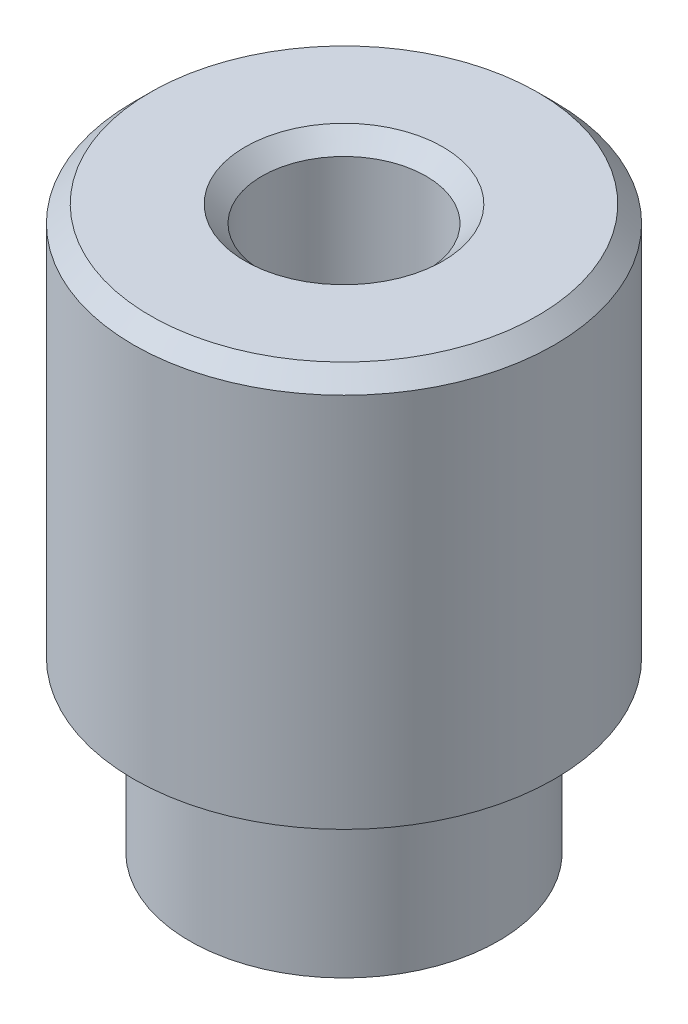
from build123d import *

# Parameters (mm, degrees)
ENL_V_MAT_EXTRU_1_DEPTH = 8
CHANFREIN1_SIZE         = 0.6


with BuildPart() as part:
    # Esquisse2 → R_volution1 (revolve)
    with BuildSketch(Plane.XY, mode=Mode.PRIVATE) as r_volution1_sk:
        with BuildLine():
            Line((-7.5, 20), (-2.925, 20))
            Line((-2.925, 20), (-2.925, 9.5))
            ThreePointArc((-2.925, 9.5), (-2.485660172, 8.439339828), (-1.425, 8))
            Line((-1.425, 8), (0, 8))
            Line((0, 8), (0, 0))
            Line((0, 0), (-5.5, 0))
            Line((-5.5, 0), (-5.5, 5.4))
            ThreePointArc((-5.5, 5.4), (-5.675735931, 5.824264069), (-6.1, 6))
            Line((-6.1, 6), (-7.5, 6))
            Line((-7.5, 6), (-7.5, 20))
        make_face()
    revolve(r_volution1_sk.sketch.rotate(Axis((0, 0, 0), (0, 1, 0)), 270), axis=Axis((0, 0, 0), (0, 1, 0)))

    # Esquisse3 → Enl_v. mat.-Extru.1 (cut)
    with BuildSketch(Plane.XZ):
        with BuildLine():
            Line((-1.6, -2.049390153), (-1.6, 2.049390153))
            ThreePointArc((-1.6, 2.049390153), (0, 2.6), (1.6, 2.049390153))
            Line((1.6, 2.049390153), (1.6, -2.049390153))
            ThreePointArc((1.6, -2.049390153), (0, -2.6), (-1.6, -2.049390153))
        make_face()
    extrude(amount=-ENL_V_MAT_EXTRU_1_DEPTH, mode=Mode.SUBTRACT)

    # Chanfrein1
    chanfrein1_edges = [part.edges().sort_by_distance(p)[0] for p in [
        (0, 20, 2.925),
        (0, 20, 7.5),
    ]]
    chamfer(chanfrein1_edges, length=CHANFREIN1_SIZE)


solid = part.part
